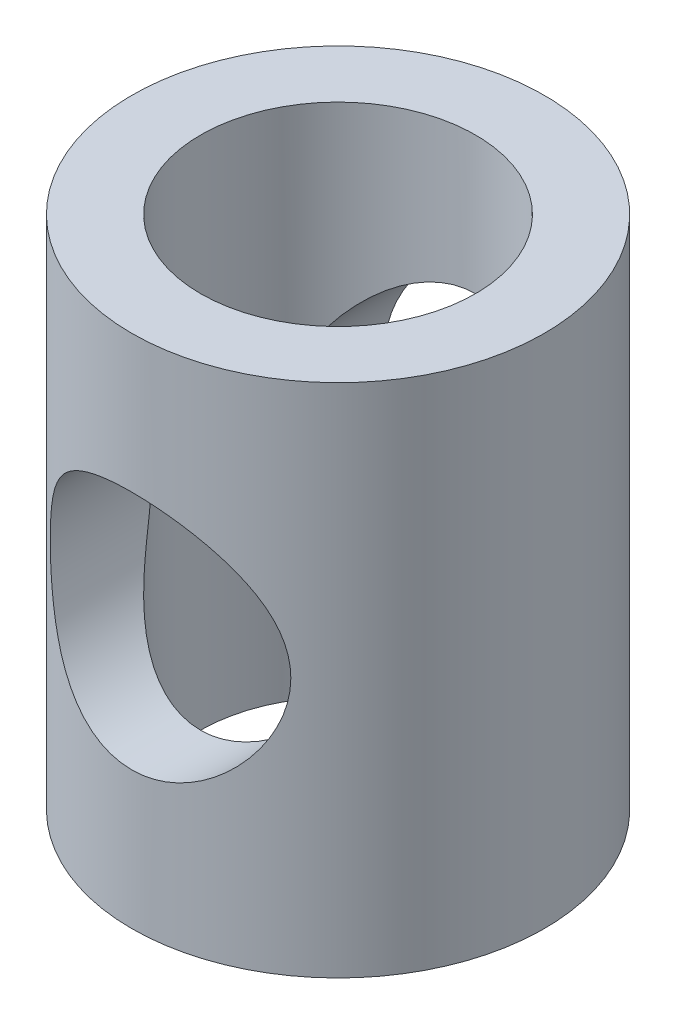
from build123d import *

# Parameters (mm, degrees)
SKETCH_1_R          = 30
SKETCH_1_R_2        = 20
EXTRUDE_1_DEPTH     = 75
SKETCH_2_R          = 17.5
CUT_EXTRUDE_1_DEPTH = 45


with BuildPart() as part:
    # Sketch 1 → Extrude 1 (new body)
    with BuildSketch(Plane(origin=(0, 0, 0), x_dir=(1, 0, 0), z_dir=(0, 1, 0))):
        with Locations(Location((0, 0, 0), (0, 0, 270))):
            Circle(SKETCH_1_R)
        with Locations(Location((0, 0, 0), (0, 0, 270))):
            Circle(SKETCH_1_R_2, mode=Mode.SUBTRACT)
    extrude(amount=EXTRUDE_1_DEPTH)

    # Sketch 2 → Cut-Extrude 1 (cut, symmetric)
    with BuildSketch(Plane.XY):
        with Locations((0, 37.5)):
            Circle(SKETCH_2_R)
    extrude(amount=CUT_EXTRUDE_1_DEPTH, both=True, mode=Mode.SUBTRACT)


solid = part.part
